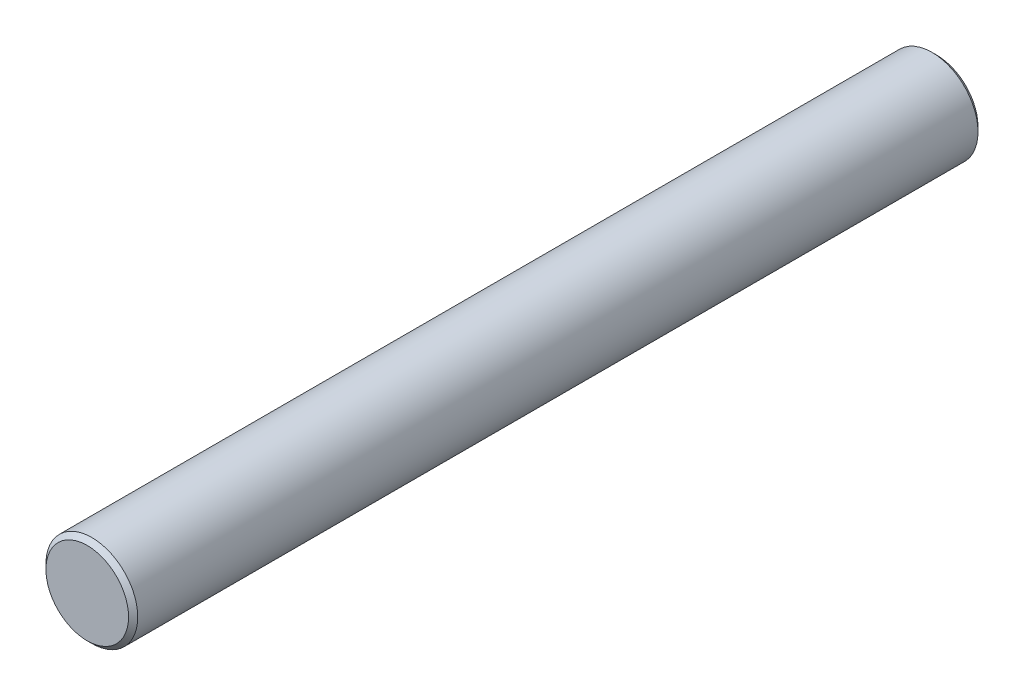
from build123d import *

# Parameters (mm, degrees)
EXTRUSION1_DEPTH      = 9.25
EXTRUSION1_DEPTH_BACK = 9.25
ESQUISSE1_R           = 1
CHANFREIN1_SIZE       = 0.1


with BuildPart() as part:
    # Esquisse1 → Extrusion1 (new, two sides: drawn at the far end of the back side and taken through both)
    with BuildSketch(Plane.XY.offset(-EXTRUSION1_DEPTH_BACK)):
        Circle(ESQUISSE1_R)
    extrude(amount=EXTRUSION1_DEPTH + EXTRUSION1_DEPTH_BACK)

    # Chanfrein1
    chanfrein1_edges = [part.edges().sort_by_distance(p)[0] for p in [
        (-1, 0, -9.25),
        (-1, 0, 9.25),
    ]]
    chamfer(chanfrein1_edges, length=CHANFREIN1_SIZE)


solid = part.part
